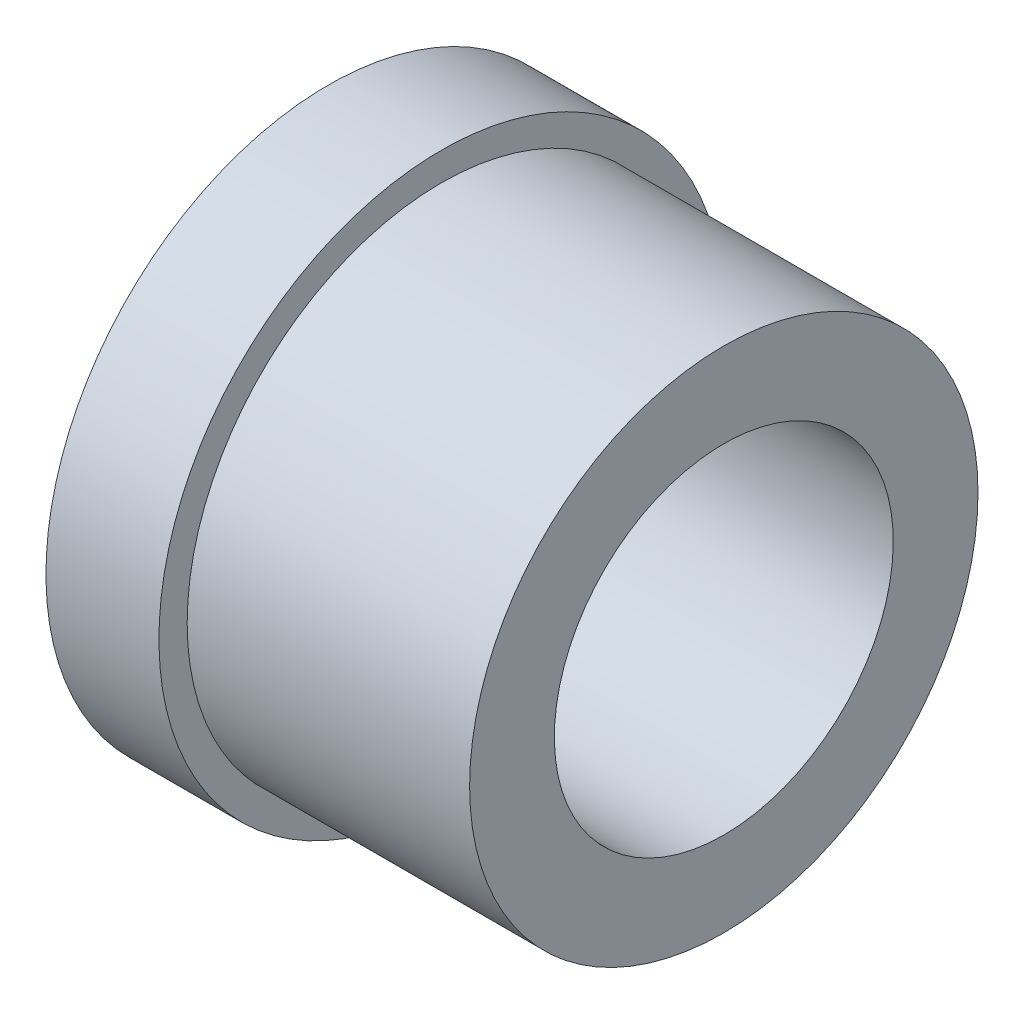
from build123d import *


with BuildPart() as part:
    # Esquisse1 → R_volution1 (revolve)
    with BuildSketch(Plane.XY, mode=Mode.PRIVATE) as r_volution1_sk:
        Polygon((-70, 5), (-70, 3), (-63, 3), (-63, 4.5), (-68, 4.5), (-68, 5), align=None)
    revolve(r_volution1_sk.sketch.rotate(Axis((-88.688569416, 0, 0), (1, 0, 0)), 180), axis=Axis((-88.688569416, 0, 0), (1, 0, 0)))


solid = part.part
